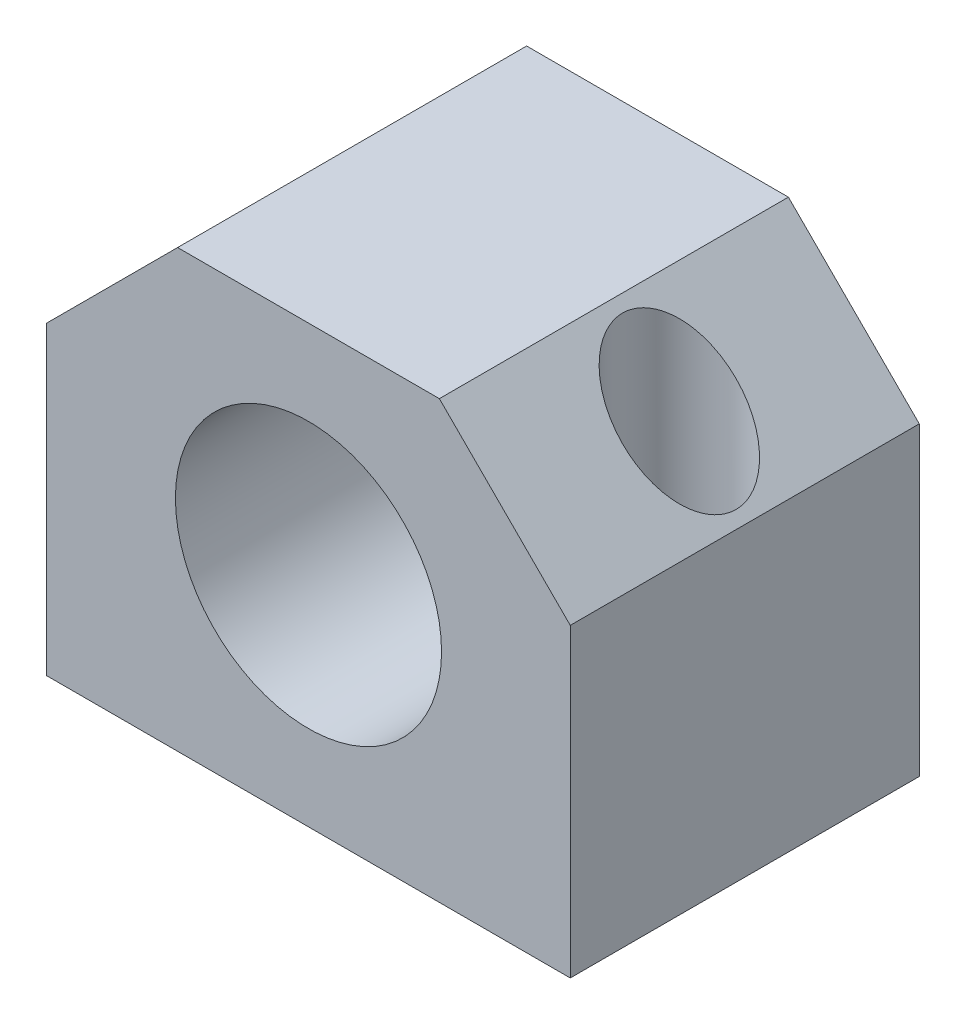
from build123d import *

# Parameters (mm, degrees)
ESQUISSE1_R          = 15.25
EXTRUSION1_DEPTH     = 40
PER_AGE6_D           = 6.5
PER_AGE6_DEPTH       = 50
PER_AGE6_CBORE_D     = 13
PER_AGE6_CBORE_DEPTH = 30
PER_AGE6_TIP         = 1.952797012


with BuildPart() as part:
    # Esquisse1 → Extrusion1 (new body)
    with BuildSketch(Plane.XY):
        Polygon((-30, -25), (30, -25), (30, 10), (15, 25), (-15, 25), (-30, 10), align=None)
        Circle(ESQUISSE1_R, mode=Mode.SUBTRACT)
    extrude(amount=EXTRUSION1_DEPTH)

    # Per_age6
    with Locations(Plane(origin=(0, 25, 0), x_dir=(-1, 0, 0), z_dir=(0, 1, 0))):
        with Locations((-22.5, 20), (22.5, 20)):
            CounterBoreHole(PER_AGE6_D / 2, PER_AGE6_CBORE_D / 2, PER_AGE6_CBORE_DEPTH, depth=PER_AGE6_DEPTH)
            with Locations((0, 0, -(PER_AGE6_DEPTH + PER_AGE6_TIP / 2))):  # 118° drill point
                Cone(0, PER_AGE6_D / 2, PER_AGE6_TIP, mode=Mode.SUBTRACT)


solid = part.part
